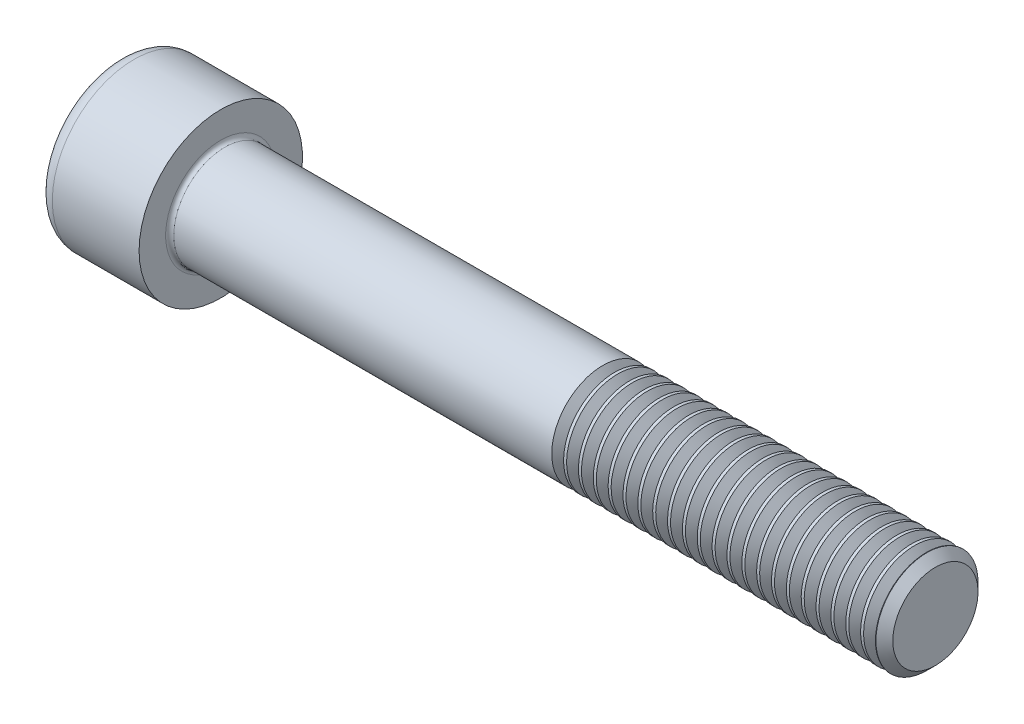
from build123d import *

# Parameters (mm, degrees)
FILLET1_R       = 0.4
FILLET2_R       = 1.5
HEX_2_DEPTH     = 5
THDSCHPAT_COUNT = 22
THDSCHPAT_PITCH = 1.454545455


with BuildPart() as part:
    # BodySke → Base-Revolve (revolve)
    with BuildSketch(Plane.XY, mode=Mode.PRIVATE) as base_revolve_sk:
        Polygon((0, 0), (0, 8), (10, 8), (10, 5), (79.172, 5), (80, 4.172), (80, 0), align=None)
    revolve(base_revolve_sk.sketch.rotate(Axis((-31.75, 0, 0), (1, 0, 0)), 180), axis=Axis((-31.75, 0, 0), (1, 0, 0)))

    # Fillet1
    fillet1_edges = [part.edges().sort_by_distance(p)[0] for p in [
        (10, 5, 0),
    ]]
    fillet(fillet1_edges, radius=FILLET1_R)

    # Fillet2
    fillet2_edges = [part.edges().sort_by_distance(p)[0] for p in [
        (0, 8, 0),
    ]]
    fillet(fillet2_edges, radius=FILLET2_R)

    # Sketch2 → Hex-PreBroach (revolve, cut)
    with BuildSketch(Plane.XY, mode=Mode.PRIVATE) as hex_prebroach_sk:
        Polygon((0, 4.0575), (5, 4.0575), (7.342598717, 0), (0, 0), align=None)
    revolve(hex_prebroach_sk.sketch.rotate(Axis((0, 0, 0), (1, 0, 0)), 180), axis=Axis((0, 0, 0), (1, 0, 0)), mode=Mode.SUBTRACT)

    # Sketch3 → Hex 2 (cut)
    with BuildSketch(Plane(origin=(0, 0, 0), x_dir=(0, 0.500000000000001, 0.866025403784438), z_dir=(-1, 0, 0))):
        Polygon((2.342598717, 4.0575), (-2.342598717, 4.0575), (-4.685197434, 0), (-2.342598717, -4.0575), (2.342598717, -4.0575), (4.685197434, 0), align=None)
    extrude(amount=-HEX_2_DEPTH, mode=Mode.SUBTRACT)

    # ThdSchSke → ThreadSchematic (revolve, cut)
    with BuildSketch(Plane.XY):
        Polygon((48, -4.172), (47.420228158, -5), (47.420228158, -6.25), (48.579771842, -6.25), (48.579771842, -5), align=None)
    threadschematic = revolve(axis=Axis((-3.175, 0, 0), (1, 0, 0)), mode=Mode.SUBTRACT)

    # ThdSchPat: ThreadSchematic ×22
    with Locations(*[(i * THDSCHPAT_PITCH, 0, 0) for i in range(1, THDSCHPAT_COUNT)]):
        add(threadschematic, mode=Mode.SUBTRACT)


solid = part.part
